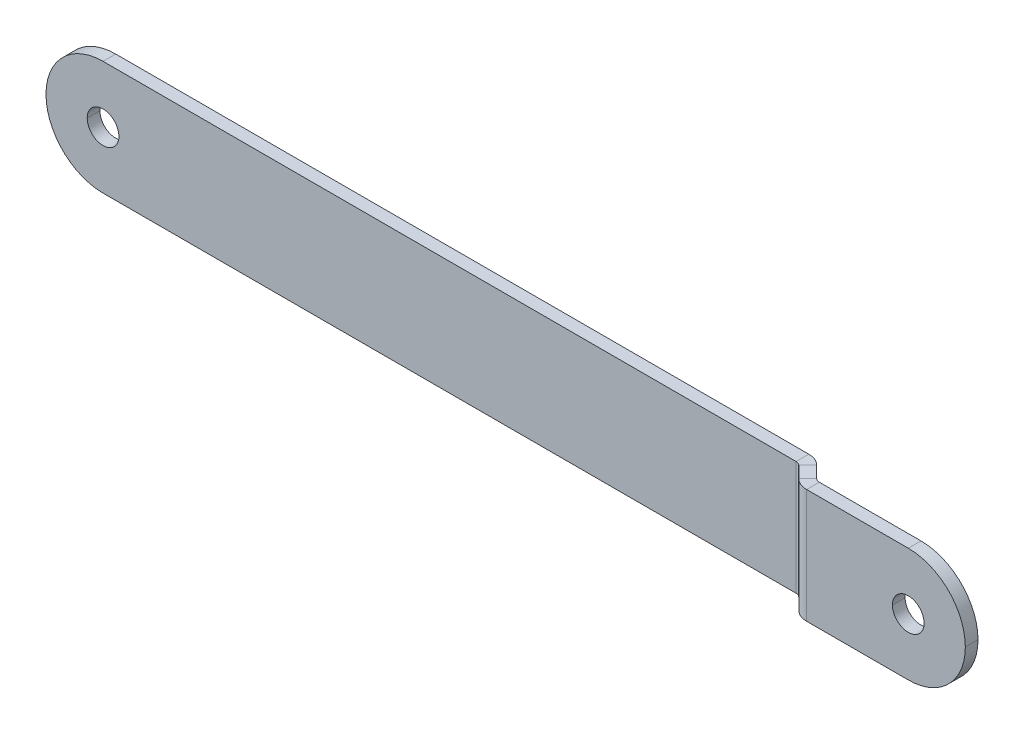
ISO-10303-21;
HEADER;
FILE_DESCRIPTION(('STEP AP214'),'2;1');
FILE_NAME('part.step','',(''),(''),'','','');
FILE_SCHEMA(('AUTOMOTIVE_DESIGN { 1 0 10303 214 1 1 1 1 }'));
ENDSEC;
DATA;
#1=APPLICATION_CONTEXT('core data for automotive mechanical design processes');
#2=APPLICATION_PROTOCOL_DEFINITION('international standard','automotive_design',2000,#1);
#3=PRODUCT_CONTEXT('',#1,'mechanical');
#4=PRODUCT('Part','Part','',(#3));
#5=PRODUCT_RELATED_PRODUCT_CATEGORY('part','',(#4));
#6=PRODUCT_DEFINITION_FORMATION('','',#4);
#7=PRODUCT_DEFINITION_CONTEXT('part definition',#1,'design');
#8=PRODUCT_DEFINITION('design','',#6,#7);
#9=PRODUCT_DEFINITION_SHAPE('','',#8);
#10=(LENGTH_UNIT() NAMED_UNIT(*) SI_UNIT(.MILLI.,.METRE.));
#11=(NAMED_UNIT(*) PLANE_ANGLE_UNIT() SI_UNIT($,.RADIAN.));
#12=(NAMED_UNIT(*) SI_UNIT($,.STERADIAN.) SOLID_ANGLE_UNIT());
#13=UNCERTAINTY_MEASURE_WITH_UNIT(LENGTH_MEASURE(1.E-05),#10,'distance_accuracy_value','');
#14=(GEOMETRIC_REPRESENTATION_CONTEXT(3) GLOBAL_UNCERTAINTY_ASSIGNED_CONTEXT((#13)) GLOBAL_UNIT_ASSIGNED_CONTEXT((#10,
#11,#12)) REPRESENTATION_CONTEXT('',''));
#15=CARTESIAN_POINT('',(0.,0.,0.));
#16=DIRECTION('',(0.,0.,1.));
#17=DIRECTION('',(1.,0.,0.));
#18=AXIS2_PLACEMENT_3D('',#15,#16,#17);
#19=CARTESIAN_POINT('',(-65.674684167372,-9.,1.00000000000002));
#20=DIRECTION('',(0.,-1.,0.));
#21=DIRECTION('',(0.,0.,-1.));
#22=AXIS2_PLACEMENT_3D('',#19,#20,#21);
#23=PLANE('',#22);
#24=DIRECTION('',(0.,0.,1.));
#25=VECTOR('',#24,1.);
#26=CARTESIAN_POINT('',(48.970416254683,-9.,1.00000000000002));
#27=LINE('',#26,#25);
#28=CARTESIAN_POINT('',(48.970416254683,-9.,1.00000000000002));
#29=VERTEX_POINT('',#28);
#30=CARTESIAN_POINT('',(48.970416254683,-9.,3.));
#31=VERTEX_POINT('',#30);
#32=EDGE_CURVE('E244',#29,#31,#27,.T.);
#33=ORIENTED_EDGE('',*,*,#32,.F.);
#34=DIRECTION('',(1.,0.,0.));
#35=VECTOR('',#34,1.);
#36=CARTESIAN_POINT('',(-65.674684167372,-9.,1.00000000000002));
#37=LINE('',#36,#35);
#38=CARTESIAN_POINT('',(65.,-9.,1.00000000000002));
#39=VERTEX_POINT('',#38);
#40=EDGE_CURVE('E238',#29,#39,#37,.T.);
#41=ORIENTED_EDGE('',*,*,#40,.T.);
#42=DIRECTION('',(0.,0.,1.));
#43=VECTOR('',#42,1.);
#44=CARTESIAN_POINT('',(65.,-9.,1.00000000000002));
#45=LINE('',#44,#43);
#46=CARTESIAN_POINT('',(65.,-9.,3.));
#47=VERTEX_POINT('',#46);
#48=EDGE_CURVE('E174',#39,#47,#45,.T.);
#49=ORIENTED_EDGE('',*,*,#48,.T.);
#50=DIRECTION('',(1.,0.,0.));
#51=VECTOR('',#50,1.);
#52=CARTESIAN_POINT('',(-65.674684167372,-9.,3.));
#53=LINE('',#52,#51);
#54=EDGE_CURVE('E9',#31,#47,#53,.T.);
#55=ORIENTED_EDGE('',*,*,#54,.F.);
#56=EDGE_LOOP('',(#33,#41,#49,#55));
#57=FACE_BOUND('',#56,.T.);
#58=ADVANCED_FACE('F15',(#57),#23,.T.);
#59=CARTESIAN_POINT('',(-65.674684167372,0.,3.));
#60=DIRECTION('',(0.,0.,1.));
#61=DIRECTION('',(1.,0.,0.));
#62=AXIS2_PLACEMENT_3D('',#59,#60,#61);
#63=PLANE('',#62);
#64=CARTESIAN_POINT('',(65.,0.,3.));
#65=DIRECTION('',(0.,0.,1.));
#66=DIRECTION('',(1.,0.,0.));
#67=AXIS2_PLACEMENT_3D('',#64,#65,#66);
#68=CIRCLE('',#67,2.5);
#69=CARTESIAN_POINT('',(67.5,0.,3.));
#70=VERTEX_POINT('',#69);
#71=CARTESIAN_POINT('',(62.5,0.,3.));
#72=VERTEX_POINT('',#71);
#73=EDGE_CURVE('E198',#70,#72,#68,.T.);
#74=ORIENTED_EDGE('',*,*,#73,.F.);
#75=CARTESIAN_POINT('',(65.,0.,3.));
#76=DIRECTION('',(0.,0.,1.));
#77=DIRECTION('',(1.,0.,0.));
#78=AXIS2_PLACEMENT_3D('',#75,#76,#77);
#79=CIRCLE('',#78,2.5);
#80=EDGE_CURVE('E183',#72,#70,#79,.T.);
#81=ORIENTED_EDGE('',*,*,#80,.F.);
#82=EDGE_LOOP('',(#74,#81));
#83=FACE_BOUND('',#82,.T.);
#84=DIRECTION('',(0.,1.,0.));
#85=VECTOR('',#84,1.);
#86=CARTESIAN_POINT('',(48.970416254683,0.,3.));
#87=LINE('',#86,#85);
#88=CARTESIAN_POINT('',(48.970416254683,9.,3.));
#89=VERTEX_POINT('',#88);
#90=EDGE_CURVE('E159',#31,#89,#87,.T.);
#91=ORIENTED_EDGE('',*,*,#90,.F.);
#92=ORIENTED_EDGE('',*,*,#54,.T.);
#93=CARTESIAN_POINT('',(65.,0.,3.));
#94=DIRECTION('',(0.,0.,1.));
#95=DIRECTION('',(1.,0.,0.));
#96=AXIS2_PLACEMENT_3D('',#93,#94,#95);
#97=CIRCLE('',#96,9.);
#98=CARTESIAN_POINT('',(74.,0.,3.));
#99=VERTEX_POINT('',#98);
#100=EDGE_CURVE('E169',#47,#99,#97,.T.);
#101=ORIENTED_EDGE('',*,*,#100,.T.);
#102=CARTESIAN_POINT('',(65.,0.,3.));
#103=DIRECTION('',(0.,0.,1.));
#104=DIRECTION('',(1.,0.,0.));
#105=AXIS2_PLACEMENT_3D('',#102,#103,#104);
#106=CIRCLE('',#105,9.);
#107=CARTESIAN_POINT('',(65.,9.,3.));
#108=VERTEX_POINT('',#107);
#109=EDGE_CURVE('E164',#99,#108,#106,.T.);
#110=ORIENTED_EDGE('',*,*,#109,.T.);
#111=DIRECTION('',(-1.,0.,0.));
#112=VECTOR('',#111,1.);
#113=CARTESIAN_POINT('',(-65.674684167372,9.,3.));
#114=LINE('',#113,#112);
#115=EDGE_CURVE('E26',#108,#89,#114,.T.);
#116=ORIENTED_EDGE('',*,*,#115,.T.);
#117=EDGE_LOOP('',(#91,#92,#101,#110,#116));
#118=FACE_BOUND('',#117,.T.);
#119=ADVANCED_FACE('F348',(#83,#118),#63,.T.);
#120=CARTESIAN_POINT('',(-65.674684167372,9.,1.00000000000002));
#121=DIRECTION('',(0.,1.,0.));
#122=DIRECTION('',(1.,0.,0.));
#123=AXIS2_PLACEMENT_3D('',#120,#121,#122);
#124=PLANE('',#123);
#125=DIRECTION('',(0.,0.,-1.));
#126=VECTOR('',#125,1.);
#127=CARTESIAN_POINT('',(48.970416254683,9.,1.00000000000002));
#128=LINE('',#127,#126);
#129=CARTESIAN_POINT('',(48.970416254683,9.,1.00000000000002));
#130=VERTEX_POINT('',#129);
#131=EDGE_CURVE('E295',#89,#130,#128,.T.);
#132=ORIENTED_EDGE('',*,*,#131,.F.);
#133=ORIENTED_EDGE('',*,*,#115,.F.);
#134=DIRECTION('',(0.,0.,1.));
#135=VECTOR('',#134,1.);
#136=CARTESIAN_POINT('',(65.,9.,1.00000000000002));
#137=LINE('',#136,#135);
#138=CARTESIAN_POINT('',(65.,9.,1.00000000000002));
#139=VERTEX_POINT('',#138);
#140=EDGE_CURVE('E158',#139,#108,#137,.T.);
#141=ORIENTED_EDGE('',*,*,#140,.F.);
#142=DIRECTION('',(-1.,0.,0.));
#143=VECTOR('',#142,1.);
#144=CARTESIAN_POINT('',(-65.674684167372,9.,1.00000000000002));
#145=LINE('',#144,#143);
#146=EDGE_CURVE('E154',#139,#130,#145,.T.);
#147=ORIENTED_EDGE('',*,*,#146,.T.);
#148=EDGE_LOOP('',(#132,#133,#141,#147));
#149=FACE_BOUND('',#148,.T.);
#150=ADVANCED_FACE('F355',(#149),#124,.T.);
#151=CARTESIAN_POINT('',(-65.674684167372,0.,1.00000000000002));
#152=DIRECTION('',(0.,0.,1.));
#153=DIRECTION('',(1.,0.,0.));
#154=AXIS2_PLACEMENT_3D('',#151,#152,#153);
#155=PLANE('',#154);
#156=CARTESIAN_POINT('',(65.,0.,1.00000000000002));
#157=DIRECTION('',(0.,0.,1.));
#158=DIRECTION('',(1.,0.,0.));
#159=AXIS2_PLACEMENT_3D('',#156,#157,#158);
#160=CIRCLE('',#159,2.5);
#161=CARTESIAN_POINT('',(67.5,0.,1.00000000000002));
#162=VERTEX_POINT('',#161);
#163=CARTESIAN_POINT('',(62.5,0.,1.00000000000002));
#164=VERTEX_POINT('',#163);
#165=EDGE_CURVE('E195',#162,#164,#160,.T.);
#166=ORIENTED_EDGE('',*,*,#165,.T.);
#167=CARTESIAN_POINT('',(65.,0.,1.00000000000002));
#168=DIRECTION('',(0.,0.,1.));
#169=DIRECTION('',(1.,0.,0.));
#170=AXIS2_PLACEMENT_3D('',#167,#168,#169);
#171=CIRCLE('',#170,2.5);
#172=EDGE_CURVE('E209',#164,#162,#171,.T.);
#173=ORIENTED_EDGE('',*,*,#172,.T.);
#174=EDGE_LOOP('',(#166,#173));
#175=FACE_BOUND('',#174,.T.);
#176=ORIENTED_EDGE('',*,*,#40,.F.);
#177=DIRECTION('',(0.,1.,0.));
#178=VECTOR('',#177,1.);
#179=CARTESIAN_POINT('',(48.970416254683,0.,1.00000000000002));
#180=LINE('',#179,#178);
#181=EDGE_CURVE('E294',#29,#130,#180,.T.);
#182=ORIENTED_EDGE('',*,*,#181,.T.);
#183=ORIENTED_EDGE('',*,*,#146,.F.);
#184=CARTESIAN_POINT('',(65.,0.,1.00000000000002));
#185=DIRECTION('',(0.,0.,1.));
#186=DIRECTION('',(1.,0.,0.));
#187=AXIS2_PLACEMENT_3D('',#184,#185,#186);
#188=CIRCLE('',#187,9.);
#189=CARTESIAN_POINT('',(74.,0.,1.00000000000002));
#190=VERTEX_POINT('',#189);
#191=EDGE_CURVE('E147',#190,#139,#188,.T.);
#192=ORIENTED_EDGE('',*,*,#191,.F.);
#193=CARTESIAN_POINT('',(65.,0.,1.00000000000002));
#194=DIRECTION('',(0.,0.,1.));
#195=DIRECTION('',(1.,0.,0.));
#196=AXIS2_PLACEMENT_3D('',#193,#194,#195);
#197=CIRCLE('',#196,9.);
#198=EDGE_CURVE('E151',#39,#190,#197,.T.);
#199=ORIENTED_EDGE('',*,*,#198,.F.);
#200=EDGE_LOOP('',(#176,#182,#183,#192,#199));
#201=FACE_BOUND('',#200,.T.);
#202=ADVANCED_FACE('F149',(#175,#201),#155,.F.);
#203=CARTESIAN_POINT('',(65.,0.,1.00000000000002));
#204=DIRECTION('',(0.,0.,1.));
#205=DIRECTION('',(1.,0.,0.));
#206=AXIS2_PLACEMENT_3D('',#203,#204,#205);
#207=CYLINDRICAL_SURFACE('',#206,2.5);
#208=DIRECTION('',(0.,0.,1.));
#209=VECTOR('',#208,1.);
#210=CARTESIAN_POINT('',(62.5,0.,1.00000000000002));
#211=LINE('',#210,#209);
#212=EDGE_CURVE('E205',#164,#72,#211,.T.);
#213=ORIENTED_EDGE('',*,*,#212,.F.);
#214=ORIENTED_EDGE('',*,*,#165,.F.);
#215=DIRECTION('',(0.,0.,1.));
#216=VECTOR('',#215,1.);
#217=CARTESIAN_POINT('',(67.5,0.,1.00000000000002));
#218=LINE('',#217,#216);
#219=EDGE_CURVE('E176',#162,#70,#218,.T.);
#220=ORIENTED_EDGE('',*,*,#219,.T.);
#221=ORIENTED_EDGE('',*,*,#73,.T.);
#222=EDGE_LOOP('',(#213,#214,#220,#221));
#223=FACE_BOUND('',#222,.T.);
#224=ADVANCED_FACE('F352',(#223),#207,.F.);
#225=CARTESIAN_POINT('',(65.,0.,1.00000000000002));
#226=DIRECTION('',(0.,0.,1.));
#227=DIRECTION('',(1.,0.,0.));
#228=AXIS2_PLACEMENT_3D('',#225,#226,#227);
#229=CYLINDRICAL_SURFACE('',#228,9.);
#230=DIRECTION('',(0.,0.,1.));
#231=VECTOR('',#230,1.);
#232=CARTESIAN_POINT('',(74.,0.,1.00000000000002));
#233=LINE('',#232,#231);
#234=EDGE_CURVE('E162',#190,#99,#233,.T.);
#235=ORIENTED_EDGE('',*,*,#234,.F.);
#236=ORIENTED_EDGE('',*,*,#191,.T.);
#237=ORIENTED_EDGE('',*,*,#140,.T.);
#238=ORIENTED_EDGE('',*,*,#109,.F.);
#239=EDGE_LOOP('',(#235,#236,#237,#238));
#240=FACE_BOUND('',#239,.T.);
#241=ADVANCED_FACE('F163',(#240),#229,.T.);
#242=CARTESIAN_POINT('',(48.970416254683,18.3132818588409,0.));
#243=DIRECTION('',(0.,-1.,0.));
#244=DIRECTION('',(0.,0.,-1.));
#245=AXIS2_PLACEMENT_3D('',#242,#243,#244);
#246=CYLINDRICAL_SURFACE('',#245,3.);
#247=CARTESIAN_POINT('',(48.970416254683,9.,0.));
#248=DIRECTION('',(0.,1.,0.));
#249=DIRECTION('',(0.,0.,-1.));
#250=AXIS2_PLACEMENT_3D('',#247,#248,#249);
#251=CIRCLE('',#250,3.);
#252=CARTESIAN_POINT('',(46.8490959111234,9.,2.12132034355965));
#253=VERTEX_POINT('',#252);
#254=EDGE_CURVE('E187',#253,#89,#251,.T.);
#255=ORIENTED_EDGE('',*,*,#254,.F.);
#256=DIRECTION('',(0.,1.,0.));
#257=VECTOR('',#256,1.);
#258=CARTESIAN_POINT('',(46.8490959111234,0.,2.12132034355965));
#259=LINE('',#258,#257);
#260=CARTESIAN_POINT('',(46.8490959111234,-9.,2.12132034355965));
#261=VERTEX_POINT('',#260);
#262=EDGE_CURVE('E193',#261,#253,#259,.T.);
#263=ORIENTED_EDGE('',*,*,#262,.F.);
#264=CARTESIAN_POINT('',(48.970416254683,-9.,0.));
#265=DIRECTION('',(0.,-1.,0.));
#266=DIRECTION('',(0.,0.,-1.));
#267=AXIS2_PLACEMENT_3D('',#264,#265,#266);
#268=CIRCLE('',#267,3.);
#269=EDGE_CURVE('E226',#31,#261,#268,.T.);
#270=ORIENTED_EDGE('',*,*,#269,.F.);
#271=ORIENTED_EDGE('',*,*,#90,.T.);
#272=EDGE_LOOP('',(#255,#263,#270,#271));
#273=FACE_BOUND('',#272,.T.);
#274=ADVANCED_FACE('F484',(#273),#246,.T.);
#275=CARTESIAN_POINT('',(48.970416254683,18.3132818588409,0.));
#276=DIRECTION('',(0.,-1.,0.));
#277=DIRECTION('',(0.,0.,-1.));
#278=AXIS2_PLACEMENT_3D('',#275,#276,#277);
#279=CYLINDRICAL_SURFACE('',#278,1.);
#280=CARTESIAN_POINT('',(48.970416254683,9.,0.));
#281=DIRECTION('',(0.,1.,0.));
#282=DIRECTION('',(0.,0.,-1.));
#283=AXIS2_PLACEMENT_3D('',#280,#281,#282);
#284=CIRCLE('',#283,1.);
#285=CARTESIAN_POINT('',(48.2633094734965,9.,0.707106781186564));
#286=VERTEX_POINT('',#285);
#287=EDGE_CURVE('E291',#286,#130,#284,.T.);
#288=ORIENTED_EDGE('',*,*,#287,.T.);
#289=ORIENTED_EDGE('',*,*,#181,.F.);
#290=CARTESIAN_POINT('',(48.970416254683,-9.,0.));
#291=DIRECTION('',(0.,-1.,0.));
#292=DIRECTION('',(0.,0.,1.));
#293=AXIS2_PLACEMENT_3D('',#290,#291,#292);
#294=CIRCLE('',#293,1.);
#295=CARTESIAN_POINT('',(48.2633094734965,-9.,0.707106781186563));
#296=VERTEX_POINT('',#295);
#297=EDGE_CURVE('E223',#29,#296,#294,.T.);
#298=ORIENTED_EDGE('',*,*,#297,.T.);
#299=DIRECTION('',(0.,1.,0.));
#300=VECTOR('',#299,1.);
#301=CARTESIAN_POINT('',(48.2633094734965,0.,0.707106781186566));
#302=LINE('',#301,#300);
#303=EDGE_CURVE('E229',#296,#286,#302,.T.);
#304=ORIENTED_EDGE('',*,*,#303,.T.);
#305=EDGE_LOOP('',(#288,#289,#298,#304));
#306=FACE_BOUND('',#305,.T.);
#307=ADVANCED_FACE('F386',(#306),#279,.F.);
#308=CARTESIAN_POINT('',(48.970416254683,9.,0.));
#309=DIRECTION('',(0.,-1.,0.));
#310=DIRECTION('',(0.,0.,-1.));
#311=AXIS2_PLACEMENT_3D('',#308,#309,#310);
#312=PLANE('',#311);
#313=DIRECTION('',(0.707106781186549,0.,-0.707106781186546));
#314=VECTOR('',#313,1.);
#315=CARTESIAN_POINT('',(48.2633094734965,9.,0.707106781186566));
#316=LINE('',#315,#314);
#317=EDGE_CURVE('E204',#253,#286,#316,.T.);
#318=ORIENTED_EDGE('',*,*,#317,.F.);
#319=ORIENTED_EDGE('',*,*,#254,.T.);
#320=ORIENTED_EDGE('',*,*,#131,.T.);
#321=ORIENTED_EDGE('',*,*,#287,.F.);
#322=EDGE_LOOP('',(#318,#319,#320,#321));
#323=FACE_BOUND('',#322,.T.);
#324=ADVANCED_FACE('F382',(#323),#312,.F.);
#325=CARTESIAN_POINT('',(48.970416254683,-9.,0.));
#326=DIRECTION('',(0.,1.,0.));
#327=DIRECTION('',(1.,0.,0.));
#328=AXIS2_PLACEMENT_3D('',#325,#326,#327);
#329=PLANE('',#328);
#330=ORIENTED_EDGE('',*,*,#32,.T.);
#331=ORIENTED_EDGE('',*,*,#269,.T.);
#332=DIRECTION('',(-0.707106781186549,0.,0.707106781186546));
#333=VECTOR('',#332,1.);
#334=CARTESIAN_POINT('',(48.2633094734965,-9.,0.707106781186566));
#335=LINE('',#334,#333);
#336=EDGE_CURVE('E231',#296,#261,#335,.T.);
#337=ORIENTED_EDGE('',*,*,#336,.F.);
#338=ORIENTED_EDGE('',*,*,#297,.F.);
#339=EDGE_LOOP('',(#330,#331,#337,#338));
#340=FACE_BOUND('',#339,.T.);
#341=ADVANCED_FACE('F385',(#340),#329,.F.);
#342=CARTESIAN_POINT('',(44.3135620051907,18.162730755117,1.));
#343=DIRECTION('',(0.,-1.,0.));
#344=DIRECTION('',(0.,0.,-1.));
#345=AXIS2_PLACEMENT_3D('',#342,#343,#344);
#346=CYLINDRICAL_SURFACE('',#345,1.);
#347=CARTESIAN_POINT('',(44.3135620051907,9.,1.));
#348=DIRECTION('',(0.,-1.,0.));
#349=DIRECTION('',(0.,0.,-1.));
#350=AXIS2_PLACEMENT_3D('',#347,#348,#349);
#351=CIRCLE('',#350,1.);
#352=CARTESIAN_POINT('',(44.3135620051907,9.,0.));
#353=VERTEX_POINT('',#352);
#354=CARTESIAN_POINT('',(45.0206687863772,9.,0.292893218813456));
#355=VERTEX_POINT('',#354);
#356=EDGE_CURVE('E316',#353,#355,#351,.T.);
#357=ORIENTED_EDGE('',*,*,#356,.F.);
#358=DIRECTION('',(0.,1.,0.));
#359=VECTOR('',#358,1.);
#360=CARTESIAN_POINT('',(44.3135620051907,0.,0.));
#361=LINE('',#360,#359);
#362=CARTESIAN_POINT('',(44.3135620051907,-9.,0.));
#363=VERTEX_POINT('',#362);
#364=EDGE_CURVE('E250',#363,#353,#361,.T.);
#365=ORIENTED_EDGE('',*,*,#364,.F.);
#366=CARTESIAN_POINT('',(44.3135620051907,-9.,1.));
#367=DIRECTION('',(0.,1.,0.));
#368=DIRECTION('',(0.,0.,-1.));
#369=AXIS2_PLACEMENT_3D('',#366,#367,#368);
#370=CIRCLE('',#369,1.);
#371=CARTESIAN_POINT('',(45.0206687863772,-9.,0.292893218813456));
#372=VERTEX_POINT('',#371);
#373=EDGE_CURVE('E312',#372,#363,#370,.T.);
#374=ORIENTED_EDGE('',*,*,#373,.F.);
#375=DIRECTION('',(0.,1.,0.));
#376=VECTOR('',#375,1.);
#377=CARTESIAN_POINT('',(45.0206687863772,0.,0.292893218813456));
#378=LINE('',#377,#376);
#379=EDGE_CURVE('E261',#372,#355,#378,.T.);
#380=ORIENTED_EDGE('',*,*,#379,.T.);
#381=EDGE_LOOP('',(#357,#365,#374,#380));
#382=FACE_BOUND('',#381,.T.);
#383=ADVANCED_FACE('F407',(#382),#346,.F.);
#384=CARTESIAN_POINT('',(44.3135620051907,18.162730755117,1.));
#385=DIRECTION('',(0.,-1.,0.));
#386=DIRECTION('',(0.,0.,-1.));
#387=AXIS2_PLACEMENT_3D('',#384,#385,#386);
#388=CYLINDRICAL_SURFACE('',#387,3.);
#389=CARTESIAN_POINT('',(44.3135620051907,9.,1.));
#390=DIRECTION('',(0.,-1.,0.));
#391=DIRECTION('',(0.,0.,1.));
#392=AXIS2_PLACEMENT_3D('',#389,#390,#391);
#393=CIRCLE('',#392,3.);
#394=CARTESIAN_POINT('',(44.3135620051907,9.,-2.));
#395=VERTEX_POINT('',#394);
#396=CARTESIAN_POINT('',(46.4348823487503,9.,-1.12132034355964));
#397=VERTEX_POINT('',#396);
#398=EDGE_CURVE('E282',#395,#397,#393,.T.);
#399=ORIENTED_EDGE('',*,*,#398,.T.);
#400=DIRECTION('',(0.,1.,0.));
#401=VECTOR('',#400,1.);
#402=CARTESIAN_POINT('',(46.4348823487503,0.,-1.12132034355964));
#403=LINE('',#402,#401);
#404=CARTESIAN_POINT('',(46.4348823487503,-9.,-1.12132034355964));
#405=VERTEX_POINT('',#404);
#406=EDGE_CURVE('E251',#405,#397,#403,.T.);
#407=ORIENTED_EDGE('',*,*,#406,.F.);
#408=CARTESIAN_POINT('',(44.3135620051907,-9.,1.));
#409=DIRECTION('',(0.,1.,0.));
#410=DIRECTION('',(0.,0.,-1.));
#411=AXIS2_PLACEMENT_3D('',#408,#409,#410);
#412=CIRCLE('',#411,3.);
#413=CARTESIAN_POINT('',(44.3135620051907,-9.,-2.));
#414=VERTEX_POINT('',#413);
#415=EDGE_CURVE('E324',#405,#414,#412,.T.);
#416=ORIENTED_EDGE('',*,*,#415,.T.);
#417=DIRECTION('',(0.,1.,0.));
#418=VECTOR('',#417,1.);
#419=CARTESIAN_POINT('',(44.3135620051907,0.,-2.));
#420=LINE('',#419,#418);
#421=EDGE_CURVE('E222',#414,#395,#420,.T.);
#422=ORIENTED_EDGE('',*,*,#421,.T.);
#423=EDGE_LOOP('',(#399,#407,#416,#422));
#424=FACE_BOUND('',#423,.T.);
#425=ADVANCED_FACE('F404',(#424),#388,.T.);
#426=CARTESIAN_POINT('',(44.3135620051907,9.,1.));
#427=DIRECTION('',(0.,1.,0.));
#428=DIRECTION('',(1.,0.,0.));
#429=AXIS2_PLACEMENT_3D('',#426,#427,#428);
#430=PLANE('',#429);
#431=DIRECTION('',(0.,0.,-1.));
#432=VECTOR('',#431,1.);
#433=CARTESIAN_POINT('',(44.3135620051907,9.,-2.));
#434=LINE('',#433,#432);
#435=EDGE_CURVE('E249',#353,#395,#434,.T.);
#436=ORIENTED_EDGE('',*,*,#435,.F.);
#437=ORIENTED_EDGE('',*,*,#356,.T.);
#438=DIRECTION('',(0.707106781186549,0.,-0.707106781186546));
#439=VECTOR('',#438,1.);
#440=CARTESIAN_POINT('',(46.4348823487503,9.,-1.12132034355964));
#441=LINE('',#440,#439);
#442=EDGE_CURVE('E203',#355,#397,#441,.T.);
#443=ORIENTED_EDGE('',*,*,#442,.T.);
#444=ORIENTED_EDGE('',*,*,#398,.F.);
#445=EDGE_LOOP('',(#436,#437,#443,#444));
#446=FACE_BOUND('',#445,.T.);
#447=ADVANCED_FACE('F17',(#446),#430,.T.);
#448=CARTESIAN_POINT('',(44.3135620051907,-9.,1.));
#449=DIRECTION('',(0.,-1.,0.));
#450=DIRECTION('',(0.,0.,-1.));
#451=AXIS2_PLACEMENT_3D('',#448,#449,#450);
#452=PLANE('',#451);
#453=DIRECTION('',(-0.707106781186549,0.,0.707106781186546));
#454=VECTOR('',#453,1.);
#455=CARTESIAN_POINT('',(46.4348823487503,-9.,-1.12132034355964));
#456=LINE('',#455,#454);
#457=EDGE_CURVE('E19',#405,#372,#456,.T.);
#458=ORIENTED_EDGE('',*,*,#457,.T.);
#459=ORIENTED_EDGE('',*,*,#373,.T.);
#460=DIRECTION('',(0.,0.,1.));
#461=VECTOR('',#460,1.);
#462=CARTESIAN_POINT('',(44.3135620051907,-9.,-2.));
#463=LINE('',#462,#461);
#464=EDGE_CURVE('E266',#414,#363,#463,.T.);
#465=ORIENTED_EDGE('',*,*,#464,.F.);
#466=ORIENTED_EDGE('',*,*,#415,.F.);
#467=EDGE_LOOP('',(#458,#459,#465,#466));
#468=FACE_BOUND('',#467,.T.);
#469=ADVANCED_FACE('F421',(#468),#452,.T.);
#470=CARTESIAN_POINT('',(-65.,9.,-2.));
#471=DIRECTION('',(0.,1.,0.));
#472=DIRECTION('',(1.,0.,0.));
#473=AXIS2_PLACEMENT_3D('',#470,#471,#472);
#474=PLANE('',#473);
#475=DIRECTION('',(-1.,0.,0.));
#476=VECTOR('',#475,1.);
#477=CARTESIAN_POINT('',(-65.,9.,0.));
#478=LINE('',#477,#476);
#479=CARTESIAN_POINT('',(-65.,9.,0.));
#480=VERTEX_POINT('',#479);
#481=EDGE_CURVE('E245',#353,#480,#478,.T.);
#482=ORIENTED_EDGE('',*,*,#481,.F.);
#483=ORIENTED_EDGE('',*,*,#435,.T.);
#484=DIRECTION('',(-1.,0.,0.));
#485=VECTOR('',#484,1.);
#486=CARTESIAN_POINT('',(-65.,9.,-2.));
#487=LINE('',#486,#485);
#488=CARTESIAN_POINT('',(-65.,9.,-2.));
#489=VERTEX_POINT('',#488);
#490=EDGE_CURVE('E452',#395,#489,#487,.T.);
#491=ORIENTED_EDGE('',*,*,#490,.T.);
#492=DIRECTION('',(0.,0.,1.));
#493=VECTOR('',#492,1.);
#494=CARTESIAN_POINT('',(-65.,9.,-2.));
#495=LINE('',#494,#493);
#496=EDGE_CURVE('E215',#489,#480,#495,.T.);
#497=ORIENTED_EDGE('',*,*,#496,.T.);
#498=EDGE_LOOP('',(#482,#483,#491,#497));
#499=FACE_BOUND('',#498,.T.);
#500=ADVANCED_FACE('F419',(#499),#474,.T.);
#501=CARTESIAN_POINT('',(-65.,0.,0.));
#502=DIRECTION('',(0.,0.,1.));
#503=DIRECTION('',(1.,0.,0.));
#504=AXIS2_PLACEMENT_3D('',#501,#502,#503);
#505=PLANE('',#504);
#506=CARTESIAN_POINT('',(-65.,0.,0.));
#507=DIRECTION('',(0.,0.,1.));
#508=DIRECTION('',(1.,0.,0.));
#509=AXIS2_PLACEMENT_3D('',#506,#507,#508);
#510=CIRCLE('',#509,2.5);
#511=CARTESIAN_POINT('',(-62.5,0.,0.));
#512=VERTEX_POINT('',#511);
#513=CARTESIAN_POINT('',(-67.5,0.,0.));
#514=VERTEX_POINT('',#513);
#515=EDGE_CURVE('E290',#512,#514,#510,.T.);
#516=ORIENTED_EDGE('',*,*,#515,.F.);
#517=CARTESIAN_POINT('',(-65.,0.,0.));
#518=DIRECTION('',(0.,0.,1.));
#519=DIRECTION('',(1.,0.,0.));
#520=AXIS2_PLACEMENT_3D('',#517,#518,#519);
#521=CIRCLE('',#520,2.5);
#522=EDGE_CURVE('E269',#514,#512,#521,.T.);
#523=ORIENTED_EDGE('',*,*,#522,.F.);
#524=EDGE_LOOP('',(#516,#523));
#525=FACE_BOUND('',#524,.T.);
#526=DIRECTION('',(1.,0.,0.));
#527=VECTOR('',#526,1.);
#528=CARTESIAN_POINT('',(-65.,-9.,0.));
#529=LINE('',#528,#527);
#530=CARTESIAN_POINT('',(-65.,-9.,0.));
#531=VERTEX_POINT('',#530);
#532=EDGE_CURVE('E262',#531,#363,#529,.T.);
#533=ORIENTED_EDGE('',*,*,#532,.T.);
#534=ORIENTED_EDGE('',*,*,#364,.T.);
#535=ORIENTED_EDGE('',*,*,#481,.T.);
#536=CARTESIAN_POINT('',(-65.,0.,0.));
#537=DIRECTION('',(0.,0.,1.));
#538=DIRECTION('',(1.,0.,0.));
#539=AXIS2_PLACEMENT_3D('',#536,#537,#538);
#540=CIRCLE('',#539,9.);
#541=EDGE_CURVE('E333',#480,#531,#540,.T.);
#542=ORIENTED_EDGE('',*,*,#541,.T.);
#543=EDGE_LOOP('',(#533,#534,#535,#542));
#544=FACE_BOUND('',#543,.T.);
#545=ADVANCED_FACE('F391',(#525,#544),#505,.T.);
#546=CARTESIAN_POINT('',(-65.,-9.,-2.));
#547=DIRECTION('',(0.,-1.,0.));
#548=DIRECTION('',(0.,0.,-1.));
#549=AXIS2_PLACEMENT_3D('',#546,#547,#548);
#550=PLANE('',#549);
#551=DIRECTION('',(1.,0.,0.));
#552=VECTOR('',#551,1.);
#553=CARTESIAN_POINT('',(-65.,-9.,-2.));
#554=LINE('',#553,#552);
#555=CARTESIAN_POINT('',(-65.,-9.,-2.));
#556=VERTEX_POINT('',#555);
#557=EDGE_CURVE('E455',#556,#414,#554,.T.);
#558=ORIENTED_EDGE('',*,*,#557,.T.);
#559=ORIENTED_EDGE('',*,*,#464,.T.);
#560=ORIENTED_EDGE('',*,*,#532,.F.);
#561=DIRECTION('',(0.,0.,1.));
#562=VECTOR('',#561,1.);
#563=CARTESIAN_POINT('',(-65.,-9.,-2.));
#564=LINE('',#563,#562);
#565=EDGE_CURVE('E214',#556,#531,#564,.T.);
#566=ORIENTED_EDGE('',*,*,#565,.F.);
#567=EDGE_LOOP('',(#558,#559,#560,#566));
#568=FACE_BOUND('',#567,.T.);
#569=ADVANCED_FACE('F387',(#568),#550,.T.);
#570=CARTESIAN_POINT('',(-65.,0.,-2.));
#571=DIRECTION('',(0.,0.,1.));
#572=DIRECTION('',(1.,0.,0.));
#573=AXIS2_PLACEMENT_3D('',#570,#571,#572);
#574=PLANE('',#573);
#575=CARTESIAN_POINT('',(-65.,0.,-2.));
#576=DIRECTION('',(0.,0.,1.));
#577=DIRECTION('',(1.,0.,0.));
#578=AXIS2_PLACEMENT_3D('',#575,#576,#577);
#579=CIRCLE('',#578,2.5);
#580=CARTESIAN_POINT('',(-62.5,0.,-2.));
#581=VERTEX_POINT('',#580);
#582=CARTESIAN_POINT('',(-67.5,0.,-2.));
#583=VERTEX_POINT('',#582);
#584=EDGE_CURVE('E255',#581,#583,#579,.T.);
#585=ORIENTED_EDGE('',*,*,#584,.T.);
#586=CARTESIAN_POINT('',(-65.,0.,-2.));
#587=DIRECTION('',(0.,0.,1.));
#588=DIRECTION('',(1.,0.,0.));
#589=AXIS2_PLACEMENT_3D('',#586,#587,#588);
#590=CIRCLE('',#589,2.5);
#591=EDGE_CURVE('E286',#583,#581,#590,.T.);
#592=ORIENTED_EDGE('',*,*,#591,.T.);
#593=EDGE_LOOP('',(#585,#592));
#594=FACE_BOUND('',#593,.T.);
#595=ORIENTED_EDGE('',*,*,#421,.F.);
#596=ORIENTED_EDGE('',*,*,#557,.F.);
#597=CARTESIAN_POINT('',(-65.,0.,-2.));
#598=DIRECTION('',(0.,0.,1.));
#599=DIRECTION('',(1.,0.,0.));
#600=AXIS2_PLACEMENT_3D('',#597,#598,#599);
#601=CIRCLE('',#600,9.);
#602=EDGE_CURVE('E210',#489,#556,#601,.T.);
#603=ORIENTED_EDGE('',*,*,#602,.F.);
#604=ORIENTED_EDGE('',*,*,#490,.F.);
#605=EDGE_LOOP('',(#595,#596,#603,#604));
#606=FACE_BOUND('',#605,.T.);
#607=ADVANCED_FACE('F390',(#594,#606),#574,.F.);
#608=CARTESIAN_POINT('',(-65.,0.,-2.));
#609=DIRECTION('',(0.,0.,1.));
#610=DIRECTION('',(1.,0.,0.));
#611=AXIS2_PLACEMENT_3D('',#608,#609,#610);
#612=CYLINDRICAL_SURFACE('',#611,9.);
#613=ORIENTED_EDGE('',*,*,#541,.F.);
#614=ORIENTED_EDGE('',*,*,#496,.F.);
#615=ORIENTED_EDGE('',*,*,#602,.T.);
#616=ORIENTED_EDGE('',*,*,#565,.T.);
#617=EDGE_LOOP('',(#613,#614,#615,#616));
#618=FACE_BOUND('',#617,.T.);
#619=ADVANCED_FACE('F412',(#618),#612,.T.);
#620=CARTESIAN_POINT('',(-65.,0.,-2.));
#621=DIRECTION('',(0.,0.,1.));
#622=DIRECTION('',(1.,0.,0.));
#623=AXIS2_PLACEMENT_3D('',#620,#621,#622);
#624=CYLINDRICAL_SURFACE('',#623,2.5);
#625=DIRECTION('',(0.,0.,1.));
#626=VECTOR('',#625,1.);
#627=CARTESIAN_POINT('',(-67.5,0.,-2.));
#628=LINE('',#627,#626);
#629=EDGE_CURVE('E273',#583,#514,#628,.T.);
#630=ORIENTED_EDGE('',*,*,#629,.F.);
#631=ORIENTED_EDGE('',*,*,#584,.F.);
#632=DIRECTION('',(0.,0.,1.));
#633=VECTOR('',#632,1.);
#634=CARTESIAN_POINT('',(-62.5,0.,-2.));
#635=LINE('',#634,#633);
#636=EDGE_CURVE('E194',#581,#512,#635,.T.);
#637=ORIENTED_EDGE('',*,*,#636,.T.);
#638=ORIENTED_EDGE('',*,*,#515,.T.);
#639=EDGE_LOOP('',(#630,#631,#637,#638));
#640=FACE_BOUND('',#639,.T.);
#641=ADVANCED_FACE('F409',(#640),#624,.F.);
#642=CARTESIAN_POINT('',(-31.8322485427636,0.,-79.3884512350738));
#643=DIRECTION('',(-0.707106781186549,0.,0.707106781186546));
#644=DIRECTION('',(0.,1.,0.));
#645=AXIS2_PLACEMENT_3D('',#642,#643,#644);
#646=PLANE('',#645);
#647=ORIENTED_EDGE('',*,*,#303,.F.);
#648=DIRECTION('',(0.707106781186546,0.,0.707106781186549));
#649=VECTOR('',#648,1.);
#650=CARTESIAN_POINT('',(-31.8322485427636,-9.,-79.3884512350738));
#651=LINE('',#650,#649);
#652=EDGE_CURVE('E235',#405,#296,#651,.T.);
#653=ORIENTED_EDGE('',*,*,#652,.F.);
#654=ORIENTED_EDGE('',*,*,#406,.T.);
#655=DIRECTION('',(-0.707106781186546,0.,-0.707106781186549));
#656=VECTOR('',#655,1.);
#657=CARTESIAN_POINT('',(-31.8322485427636,9.,-79.3884512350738));
#658=LINE('',#657,#656);
#659=EDGE_CURVE('E199',#286,#397,#658,.T.);
#660=ORIENTED_EDGE('',*,*,#659,.F.);
#661=EDGE_LOOP('',(#647,#653,#654,#660));
#662=FACE_BOUND('',#661,.T.);
#663=ADVANCED_FACE('F396',(#662),#646,.F.);
#664=CARTESIAN_POINT('',(-31.8322485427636,9.,-79.3884512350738));
#665=DIRECTION('',(0.,1.,0.));
#666=DIRECTION('',(0.,0.,-1.));
#667=AXIS2_PLACEMENT_3D('',#664,#665,#666);
#668=PLANE('',#667);
#669=DIRECTION('',(-0.707106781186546,0.,-0.707106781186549));
#670=VECTOR('',#669,1.);
#671=CARTESIAN_POINT('',(-33.2464621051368,9.,-77.9742376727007));
#672=LINE('',#671,#670);
#673=EDGE_CURVE('E336',#253,#355,#672,.T.);
#674=ORIENTED_EDGE('',*,*,#673,.F.);
#675=ORIENTED_EDGE('',*,*,#317,.T.);
#676=ORIENTED_EDGE('',*,*,#659,.T.);
#677=ORIENTED_EDGE('',*,*,#442,.F.);
#678=EDGE_LOOP('',(#674,#675,#676,#677));
#679=FACE_BOUND('',#678,.T.);
#680=ADVANCED_FACE('F393',(#679),#668,.T.);
#681=CARTESIAN_POINT('',(-31.8322485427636,-9.,-79.3884512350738));
#682=DIRECTION('',(0.,-1.,0.));
#683=DIRECTION('',(-1.,0.,0.));
#684=AXIS2_PLACEMENT_3D('',#681,#682,#683);
#685=PLANE('',#684);
#686=ORIENTED_EDGE('',*,*,#652,.T.);
#687=ORIENTED_EDGE('',*,*,#336,.T.);
#688=DIRECTION('',(0.707106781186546,0.,0.707106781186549));
#689=VECTOR('',#688,1.);
#690=CARTESIAN_POINT('',(-33.2464621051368,-9.,-77.9742376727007));
#691=LINE('',#690,#689);
#692=EDGE_CURVE('E189',#372,#261,#691,.T.);
#693=ORIENTED_EDGE('',*,*,#692,.F.);
#694=ORIENTED_EDGE('',*,*,#457,.F.);
#695=EDGE_LOOP('',(#686,#687,#693,#694));
#696=FACE_BOUND('',#695,.T.);
#697=ADVANCED_FACE('F380',(#696),#685,.T.);
#698=CARTESIAN_POINT('',(-33.2464621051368,0.,-77.9742376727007));
#699=DIRECTION('',(-0.707106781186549,0.,0.707106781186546));
#700=DIRECTION('',(0.,1.,0.));
#701=AXIS2_PLACEMENT_3D('',#698,#699,#700);
#702=PLANE('',#701);
#703=ORIENTED_EDGE('',*,*,#692,.T.);
#704=ORIENTED_EDGE('',*,*,#262,.T.);
#705=ORIENTED_EDGE('',*,*,#673,.T.);
#706=ORIENTED_EDGE('',*,*,#379,.F.);
#707=EDGE_LOOP('',(#703,#704,#705,#706));
#708=FACE_BOUND('',#707,.T.);
#709=ADVANCED_FACE('F376',(#708),#702,.T.);
#710=CARTESIAN_POINT('',(-65.,0.,-2.));
#711=DIRECTION('',(0.,0.,1.));
#712=DIRECTION('',(1.,0.,0.));
#713=AXIS2_PLACEMENT_3D('',#710,#711,#712);
#714=CYLINDRICAL_SURFACE('',#713,2.5);
#715=ORIENTED_EDGE('',*,*,#591,.F.);
#716=ORIENTED_EDGE('',*,*,#629,.T.);
#717=ORIENTED_EDGE('',*,*,#522,.T.);
#718=ORIENTED_EDGE('',*,*,#636,.F.);
#719=EDGE_LOOP('',(#715,#716,#717,#718));
#720=FACE_BOUND('',#719,.T.);
#721=ADVANCED_FACE('F379',(#720),#714,.F.);
#722=CARTESIAN_POINT('',(65.,0.,1.00000000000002));
#723=DIRECTION('',(0.,0.,1.));
#724=DIRECTION('',(1.,0.,0.));
#725=AXIS2_PLACEMENT_3D('',#722,#723,#724);
#726=CYLINDRICAL_SURFACE('',#725,9.);
#727=ORIENTED_EDGE('',*,*,#198,.T.);
#728=ORIENTED_EDGE('',*,*,#234,.T.);
#729=ORIENTED_EDGE('',*,*,#100,.F.);
#730=ORIENTED_EDGE('',*,*,#48,.F.);
#731=EDGE_LOOP('',(#727,#728,#729,#730));
#732=FACE_BOUND('',#731,.T.);
#733=ADVANCED_FACE('F172',(#732),#726,.T.);
#734=CARTESIAN_POINT('',(65.,0.,1.00000000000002));
#735=DIRECTION('',(0.,0.,1.));
#736=DIRECTION('',(1.,0.,0.));
#737=AXIS2_PLACEMENT_3D('',#734,#735,#736);
#738=CYLINDRICAL_SURFACE('',#737,2.5);
#739=ORIENTED_EDGE('',*,*,#172,.F.);
#740=ORIENTED_EDGE('',*,*,#212,.T.);
#741=ORIENTED_EDGE('',*,*,#80,.T.);
#742=ORIENTED_EDGE('',*,*,#219,.F.);
#743=EDGE_LOOP('',(#739,#740,#741,#742));
#744=FACE_BOUND('',#743,.T.);
#745=ADVANCED_FACE('F345',(#744),#738,.F.);
#746=CLOSED_SHELL('',(#58,#119,#150,#202,#224,#241,#274,#307,#324,#341,#383,#425,#447,#469,#500,
#545,#569,#607,#619,#641,#663,#680,#697,#709,#721,#733,#745));
#747=MANIFOLD_SOLID_BREP('B1',#746);
#748=ADVANCED_BREP_SHAPE_REPRESENTATION('',(#18,#747),#14);
#749=SHAPE_DEFINITION_REPRESENTATION(#9,#748);
ENDSEC;
END-ISO-10303-21;
